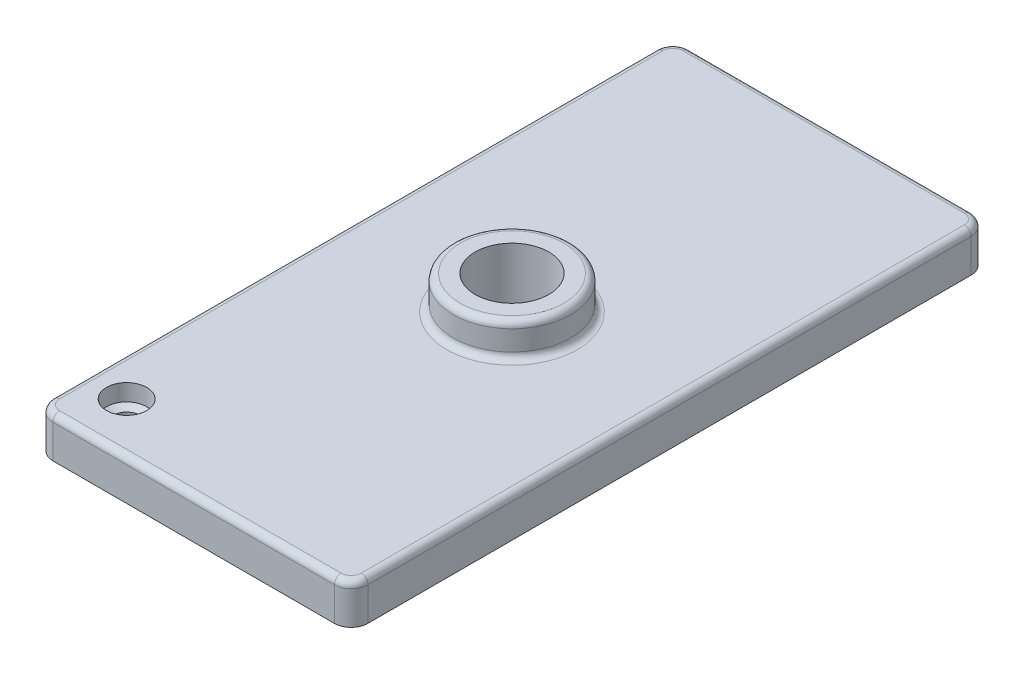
ISO-10303-21;
HEADER;
FILE_DESCRIPTION(('STEP AP214'),'2;1');
FILE_NAME('part.step','',(''),(''),'','','');
FILE_SCHEMA(('AUTOMOTIVE_DESIGN { 1 0 10303 214 1 1 1 1 }'));
ENDSEC;
DATA;
#1=APPLICATION_CONTEXT('core data for automotive mechanical design processes');
#2=APPLICATION_PROTOCOL_DEFINITION('international standard','automotive_design',2000,#1);
#3=PRODUCT_CONTEXT('',#1,'mechanical');
#4=PRODUCT('Part','Part','',(#3));
#5=PRODUCT_RELATED_PRODUCT_CATEGORY('part','',(#4));
#6=PRODUCT_DEFINITION_FORMATION('','',#4);
#7=PRODUCT_DEFINITION_CONTEXT('part definition',#1,'design');
#8=PRODUCT_DEFINITION('design','',#6,#7);
#9=PRODUCT_DEFINITION_SHAPE('','',#8);
#10=(LENGTH_UNIT() NAMED_UNIT(*) SI_UNIT(.MILLI.,.METRE.));
#11=(NAMED_UNIT(*) PLANE_ANGLE_UNIT() SI_UNIT($,.RADIAN.));
#12=(NAMED_UNIT(*) SI_UNIT($,.STERADIAN.) SOLID_ANGLE_UNIT());
#13=UNCERTAINTY_MEASURE_WITH_UNIT(LENGTH_MEASURE(1.E-05),#10,'distance_accuracy_value','');
#14=(GEOMETRIC_REPRESENTATION_CONTEXT(3) GLOBAL_UNCERTAINTY_ASSIGNED_CONTEXT((#13)) GLOBAL_UNIT_ASSIGNED_CONTEXT((#10,
#11,#12)) REPRESENTATION_CONTEXT('',''));
#15=CARTESIAN_POINT('',(0.,0.,0.));
#16=DIRECTION('',(0.,0.,1.));
#17=DIRECTION('',(1.,0.,0.));
#18=AXIS2_PLACEMENT_3D('',#15,#16,#17);
#19=CARTESIAN_POINT('',(-47.,12.,-95.));
#20=DIRECTION('',(0.,-1.,0.));
#21=DIRECTION('',(0.,0.,-1.));
#22=AXIS2_PLACEMENT_3D('',#19,#20,#21);
#23=PLANE('',#22);
#24=CARTESIAN_POINT('',(42.,12.,90.));
#25=DIRECTION('',(0.,-1.,0.));
#26=DIRECTION('',(0.,0.,-1.));
#27=AXIS2_PLACEMENT_3D('',#24,#25,#26);
#28=CIRCLE('',#27,3.);
#29=CARTESIAN_POINT('',(42.,12.,93.));
#30=VERTEX_POINT('',#29);
#31=CARTESIAN_POINT('',(45.,12.,90.));
#32=VERTEX_POINT('',#31);
#33=EDGE_CURVE('E199',#30,#32,#28,.F.);
#34=ORIENTED_EDGE('',*,*,#33,.T.);
#35=DIRECTION('',(0.,0.,-1.));
#36=VECTOR('',#35,1.);
#37=CARTESIAN_POINT('',(45.,12.,-95.));
#38=LINE('',#37,#36);
#39=CARTESIAN_POINT('',(45.,12.,-90.));
#40=VERTEX_POINT('',#39);
#41=EDGE_CURVE('E201',#32,#40,#38,.T.);
#42=ORIENTED_EDGE('',*,*,#41,.T.);
#43=CARTESIAN_POINT('',(42.,12.,-90.));
#44=DIRECTION('',(0.,-1.,0.));
#45=DIRECTION('',(0.,0.,-1.));
#46=AXIS2_PLACEMENT_3D('',#43,#44,#45);
#47=CIRCLE('',#46,3.);
#48=CARTESIAN_POINT('',(42.,12.,-93.));
#49=VERTEX_POINT('',#48);
#50=EDGE_CURVE('E204',#40,#49,#47,.F.);
#51=ORIENTED_EDGE('',*,*,#50,.T.);
#52=DIRECTION('',(-1.,0.,0.));
#53=VECTOR('',#52,1.);
#54=CARTESIAN_POINT('',(-47.,12.,-93.));
#55=LINE('',#54,#53);
#56=CARTESIAN_POINT('',(-42.,12.,-93.));
#57=VERTEX_POINT('',#56);
#58=EDGE_CURVE('E196',#49,#57,#55,.T.);
#59=ORIENTED_EDGE('',*,*,#58,.T.);
#60=CARTESIAN_POINT('',(-42.,12.,-90.));
#61=DIRECTION('',(0.,-1.,0.));
#62=DIRECTION('',(0.,0.,-1.));
#63=AXIS2_PLACEMENT_3D('',#60,#61,#62);
#64=CIRCLE('',#63,3.);
#65=CARTESIAN_POINT('',(-45.,12.,-90.));
#66=VERTEX_POINT('',#65);
#67=EDGE_CURVE('E191',#57,#66,#64,.F.);
#68=ORIENTED_EDGE('',*,*,#67,.T.);
#69=DIRECTION('',(0.,0.,1.));
#70=VECTOR('',#69,1.);
#71=CARTESIAN_POINT('',(-45.,12.,-95.));
#72=LINE('',#71,#70);
#73=CARTESIAN_POINT('',(-45.,12.,90.));
#74=VERTEX_POINT('',#73);
#75=EDGE_CURVE('E188',#66,#74,#72,.T.);
#76=ORIENTED_EDGE('',*,*,#75,.T.);
#77=CARTESIAN_POINT('',(-42.,12.,90.));
#78=DIRECTION('',(0.,-1.,0.));
#79=DIRECTION('',(0.,0.,-1.));
#80=AXIS2_PLACEMENT_3D('',#77,#78,#79);
#81=CIRCLE('',#80,3.);
#82=CARTESIAN_POINT('',(-42.,12.,93.));
#83=VERTEX_POINT('',#82);
#84=EDGE_CURVE('E195',#74,#83,#81,.F.);
#85=ORIENTED_EDGE('',*,*,#84,.T.);
#86=DIRECTION('',(1.,0.,0.));
#87=VECTOR('',#86,1.);
#88=CARTESIAN_POINT('',(-47.,12.,93.));
#89=LINE('',#88,#87);
#90=EDGE_CURVE('E198',#83,#30,#89,.T.);
#91=ORIENTED_EDGE('',*,*,#90,.T.);
#92=EDGE_LOOP('',(#34,#42,#51,#59,#68,#76,#85,#91));
#93=FACE_BOUND('',#92,.T.);
#94=CARTESIAN_POINT('',(0.,12.,0.));
#95=DIRECTION('',(0.,-1.,0.));
#96=DIRECTION('',(0.,0.,-1.));
#97=AXIS2_PLACEMENT_3D('',#94,#95,#96);
#98=CIRCLE('',#97,19.5);
#99=CARTESIAN_POINT('',(0.,12.,-19.5));
#100=VERTEX_POINT('',#99);
#101=EDGE_CURVE('E190',#100,#100,#98,.T.);
#102=ORIENTED_EDGE('',*,*,#101,.T.);
#103=EDGE_LOOP('',(#102));
#104=FACE_BOUND('',#103,.T.);
#105=CARTESIAN_POINT('',(-35.,12.,80.));
#106=DIRECTION('',(0.,1.,0.));
#107=DIRECTION('',(0.,0.,1.));
#108=AXIS2_PLACEMENT_3D('',#105,#106,#107);
#109=CIRCLE('',#108,6.);
#110=CARTESIAN_POINT('',(-35.,12.,86.));
#111=VERTEX_POINT('',#110);
#112=EDGE_CURVE('E265',#111,#111,#109,.T.);
#113=ORIENTED_EDGE('',*,*,#112,.F.);
#114=EDGE_LOOP('',(#113));
#115=FACE_BOUND('',#114,.T.);
#116=ADVANCED_FACE('F41',(#93,#104,#115),#23,.F.);
#117=CARTESIAN_POINT('',(-47.,12.,95.));
#118=DIRECTION('',(1.,0.,0.));
#119=DIRECTION('',(0.,0.,-1.));
#120=AXIS2_PLACEMENT_3D('',#117,#118,#119);
#121=PLANE('',#120);
#122=DIRECTION('',(0.,-1.,0.));
#123=VECTOR('',#122,1.);
#124=CARTESIAN_POINT('',(-47.,12.,90.));
#125=LINE('',#124,#123);
#126=CARTESIAN_POINT('',(-47.,0.,90.));
#127=VERTEX_POINT('',#126);
#128=CARTESIAN_POINT('',(-47.,10.,90.));
#129=VERTEX_POINT('',#128);
#130=EDGE_CURVE('E179',#127,#129,#125,.F.);
#131=ORIENTED_EDGE('',*,*,#130,.T.);
#132=DIRECTION('',(0.,0.,1.));
#133=VECTOR('',#132,1.);
#134=CARTESIAN_POINT('',(-47.,10.,95.));
#135=LINE('',#134,#133);
#136=CARTESIAN_POINT('',(-47.,10.,-90.));
#137=VERTEX_POINT('',#136);
#138=EDGE_CURVE('E63',#129,#137,#135,.F.);
#139=ORIENTED_EDGE('',*,*,#138,.T.);
#140=DIRECTION('',(0.,-1.,0.));
#141=VECTOR('',#140,1.);
#142=CARTESIAN_POINT('',(-47.,12.,-90.));
#143=LINE('',#142,#141);
#144=CARTESIAN_POINT('',(-47.,0.,-90.));
#145=VERTEX_POINT('',#144);
#146=EDGE_CURVE('E178',#137,#145,#143,.T.);
#147=ORIENTED_EDGE('',*,*,#146,.T.);
#148=DIRECTION('',(0.,0.,1.));
#149=VECTOR('',#148,1.);
#150=CARTESIAN_POINT('',(-47.,0.,95.));
#151=LINE('',#150,#149);
#152=EDGE_CURVE('E170',#145,#127,#151,.T.);
#153=ORIENTED_EDGE('',*,*,#152,.T.);
#154=EDGE_LOOP('',(#131,#139,#147,#153));
#155=FACE_BOUND('',#154,.T.);
#156=ADVANCED_FACE('F275',(#155),#121,.F.);
#157=CARTESIAN_POINT('',(-47.,12.,95.));
#158=DIRECTION('',(0.,0.,-1.));
#159=DIRECTION('',(-1.,0.,0.));
#160=AXIS2_PLACEMENT_3D('',#157,#158,#159);
#161=PLANE('',#160);
#162=DIRECTION('',(0.,-1.,0.));
#163=VECTOR('',#162,1.);
#164=CARTESIAN_POINT('',(42.,12.,95.));
#165=LINE('',#164,#163);
#166=CARTESIAN_POINT('',(42.,0.,95.));
#167=VERTEX_POINT('',#166);
#168=CARTESIAN_POINT('',(42.,10.,95.));
#169=VERTEX_POINT('',#168);
#170=EDGE_CURVE('E154',#167,#169,#165,.F.);
#171=ORIENTED_EDGE('',*,*,#170,.T.);
#172=DIRECTION('',(1.,0.,0.));
#173=VECTOR('',#172,1.);
#174=CARTESIAN_POINT('',(-47.,10.,95.));
#175=LINE('',#174,#173);
#176=CARTESIAN_POINT('',(-42.,10.,95.));
#177=VERTEX_POINT('',#176);
#178=EDGE_CURVE('E211',#169,#177,#175,.F.);
#179=ORIENTED_EDGE('',*,*,#178,.T.);
#180=DIRECTION('',(0.,-1.,0.));
#181=VECTOR('',#180,1.);
#182=CARTESIAN_POINT('',(-42.,12.,95.));
#183=LINE('',#182,#181);
#184=CARTESIAN_POINT('',(-42.,0.,95.));
#185=VERTEX_POINT('',#184);
#186=EDGE_CURVE('E156',#177,#185,#183,.T.);
#187=ORIENTED_EDGE('',*,*,#186,.T.);
#188=DIRECTION('',(1.,0.,0.));
#189=VECTOR('',#188,1.);
#190=CARTESIAN_POINT('',(-47.,0.,95.));
#191=LINE('',#190,#189);
#192=EDGE_CURVE('E161',#185,#167,#191,.T.);
#193=ORIENTED_EDGE('',*,*,#192,.T.);
#194=EDGE_LOOP('',(#171,#179,#187,#193));
#195=FACE_BOUND('',#194,.T.);
#196=ADVANCED_FACE('F280',(#195),#161,.F.);
#197=CARTESIAN_POINT('',(47.,12.,95.));
#198=DIRECTION('',(-1.,0.,0.));
#199=DIRECTION('',(0.,0.,1.));
#200=AXIS2_PLACEMENT_3D('',#197,#198,#199);
#201=PLANE('',#200);
#202=DIRECTION('',(0.,-1.,0.));
#203=VECTOR('',#202,1.);
#204=CARTESIAN_POINT('',(47.,12.,-90.));
#205=LINE('',#204,#203);
#206=CARTESIAN_POINT('',(47.,0.,-90.));
#207=VERTEX_POINT('',#206);
#208=CARTESIAN_POINT('',(47.,10.,-90.));
#209=VERTEX_POINT('',#208);
#210=EDGE_CURVE('E147',#207,#209,#205,.F.);
#211=ORIENTED_EDGE('',*,*,#210,.T.);
#212=DIRECTION('',(0.,0.,-1.));
#213=VECTOR('',#212,1.);
#214=CARTESIAN_POINT('',(47.,10.,95.));
#215=LINE('',#214,#213);
#216=CARTESIAN_POINT('',(47.,10.,90.));
#217=VERTEX_POINT('',#216);
#218=EDGE_CURVE('E141',#209,#217,#215,.F.);
#219=ORIENTED_EDGE('',*,*,#218,.T.);
#220=DIRECTION('',(0.,-1.,0.));
#221=VECTOR('',#220,1.);
#222=CARTESIAN_POINT('',(47.,12.,90.));
#223=LINE('',#222,#221);
#224=CARTESIAN_POINT('',(47.,0.,90.));
#225=VERTEX_POINT('',#224);
#226=EDGE_CURVE('E134',#217,#225,#223,.T.);
#227=ORIENTED_EDGE('',*,*,#226,.T.);
#228=DIRECTION('',(0.,0.,-1.));
#229=VECTOR('',#228,1.);
#230=CARTESIAN_POINT('',(47.,0.,95.));
#231=LINE('',#230,#229);
#232=EDGE_CURVE('E138',#225,#207,#231,.T.);
#233=ORIENTED_EDGE('',*,*,#232,.T.);
#234=EDGE_LOOP('',(#211,#219,#227,#233));
#235=FACE_BOUND('',#234,.T.);
#236=ADVANCED_FACE('F140',(#235),#201,.F.);
#237=CARTESIAN_POINT('',(-47.,12.,-95.));
#238=DIRECTION('',(0.,0.,1.));
#239=DIRECTION('',(1.,0.,0.));
#240=AXIS2_PLACEMENT_3D('',#237,#238,#239);
#241=PLANE('',#240);
#242=DIRECTION('',(0.,-1.,0.));
#243=VECTOR('',#242,1.);
#244=CARTESIAN_POINT('',(-42.,12.,-95.));
#245=LINE('',#244,#243);
#246=CARTESIAN_POINT('',(-42.,0.,-95.));
#247=VERTEX_POINT('',#246);
#248=CARTESIAN_POINT('',(-42.,10.,-95.));
#249=VERTEX_POINT('',#248);
#250=EDGE_CURVE('E183',#247,#249,#245,.F.);
#251=ORIENTED_EDGE('',*,*,#250,.T.);
#252=DIRECTION('',(-1.,0.,0.));
#253=VECTOR('',#252,1.);
#254=CARTESIAN_POINT('',(-47.,10.,-95.));
#255=LINE('',#254,#253);
#256=CARTESIAN_POINT('',(42.,10.,-95.));
#257=VERTEX_POINT('',#256);
#258=EDGE_CURVE('E215',#249,#257,#255,.F.);
#259=ORIENTED_EDGE('',*,*,#258,.T.);
#260=DIRECTION('',(0.,-1.,0.));
#261=VECTOR('',#260,1.);
#262=CARTESIAN_POINT('',(42.,12.,-95.));
#263=LINE('',#262,#261);
#264=CARTESIAN_POINT('',(42.,0.,-95.));
#265=VERTEX_POINT('',#264);
#266=EDGE_CURVE('E185',#257,#265,#263,.T.);
#267=ORIENTED_EDGE('',*,*,#266,.T.);
#268=DIRECTION('',(-1.,0.,0.));
#269=VECTOR('',#268,1.);
#270=CARTESIAN_POINT('',(-47.,0.,-95.));
#271=LINE('',#270,#269);
#272=EDGE_CURVE('E162',#265,#247,#271,.T.);
#273=ORIENTED_EDGE('',*,*,#272,.T.);
#274=EDGE_LOOP('',(#251,#259,#267,#273));
#275=FACE_BOUND('',#274,.T.);
#276=ADVANCED_FACE('F319',(#275),#241,.F.);
#277=CARTESIAN_POINT('',(-47.,0.,-95.));
#278=DIRECTION('',(0.,-1.,0.));
#279=DIRECTION('',(0.,0.,-1.));
#280=AXIS2_PLACEMENT_3D('',#277,#278,#279);
#281=PLANE('',#280);
#282=CARTESIAN_POINT('',(-35.,0.,80.));
#283=DIRECTION('',(0.,1.,0.));
#284=DIRECTION('',(0.,0.,1.));
#285=AXIS2_PLACEMENT_3D('',#282,#283,#284);
#286=CIRCLE('',#285,4.);
#287=CARTESIAN_POINT('',(-35.,0.,84.));
#288=VERTEX_POINT('',#287);
#289=EDGE_CURVE('E250',#288,#288,#286,.T.);
#290=ORIENTED_EDGE('',*,*,#289,.T.);
#291=EDGE_LOOP('',(#290));
#292=FACE_BOUND('',#291,.T.);
#293=CARTESIAN_POINT('',(0.,0.,0.));
#294=DIRECTION('',(0.,1.,0.));
#295=DIRECTION('',(0.,0.,1.));
#296=AXIS2_PLACEMENT_3D('',#293,#294,#295);
#297=CIRCLE('',#296,11.);
#298=CARTESIAN_POINT('',(0.,0.,11.));
#299=VERTEX_POINT('',#298);
#300=EDGE_CURVE('E267',#299,#299,#297,.T.);
#301=ORIENTED_EDGE('',*,*,#300,.T.);
#302=EDGE_LOOP('',(#301));
#303=FACE_BOUND('',#302,.T.);
#304=ORIENTED_EDGE('',*,*,#232,.F.);
#305=CARTESIAN_POINT('',(42.,0.,90.));
#306=DIRECTION('',(0.,-1.,0.));
#307=DIRECTION('',(0.,0.,-1.));
#308=AXIS2_PLACEMENT_3D('',#305,#306,#307);
#309=CIRCLE('',#308,5.);
#310=EDGE_CURVE('E146',#225,#167,#309,.T.);
#311=ORIENTED_EDGE('',*,*,#310,.T.);
#312=ORIENTED_EDGE('',*,*,#192,.F.);
#313=CARTESIAN_POINT('',(-42.,0.,90.));
#314=DIRECTION('',(0.,-1.,0.));
#315=DIRECTION('',(0.,0.,-1.));
#316=AXIS2_PLACEMENT_3D('',#313,#314,#315);
#317=CIRCLE('',#316,5.);
#318=EDGE_CURVE('E160',#185,#127,#317,.T.);
#319=ORIENTED_EDGE('',*,*,#318,.T.);
#320=ORIENTED_EDGE('',*,*,#152,.F.);
#321=CARTESIAN_POINT('',(-42.,0.,-90.));
#322=DIRECTION('',(0.,-1.,0.));
#323=DIRECTION('',(0.,0.,-1.));
#324=AXIS2_PLACEMENT_3D('',#321,#322,#323);
#325=CIRCLE('',#324,5.);
#326=EDGE_CURVE('E173',#145,#247,#325,.T.);
#327=ORIENTED_EDGE('',*,*,#326,.T.);
#328=ORIENTED_EDGE('',*,*,#272,.F.);
#329=CARTESIAN_POINT('',(42.,0.,-90.));
#330=DIRECTION('',(0.,-1.,0.));
#331=DIRECTION('',(0.,0.,-1.));
#332=AXIS2_PLACEMENT_3D('',#329,#330,#331);
#333=CIRCLE('',#332,5.);
#334=EDGE_CURVE('E143',#265,#207,#333,.T.);
#335=ORIENTED_EDGE('',*,*,#334,.T.);
#336=EDGE_LOOP('',(#304,#311,#312,#319,#320,#327,#328,#335));
#337=FACE_BOUND('',#336,.T.);
#338=ADVANCED_FACE('F158',(#292,#303,#337),#281,.T.);
#339=CARTESIAN_POINT('',(0.,22.,0.));
#340=DIRECTION('',(0.,-1.,0.));
#341=DIRECTION('',(0.,0.,-1.));
#342=AXIS2_PLACEMENT_3D('',#339,#340,#341);
#343=CYLINDRICAL_SURFACE('',#342,17.5);
#344=CARTESIAN_POINT('',(0.,14.,0.));
#345=DIRECTION('',(0.,-1.,0.));
#346=DIRECTION('',(0.,0.,-1.));
#347=AXIS2_PLACEMENT_3D('',#344,#345,#346);
#348=CIRCLE('',#347,17.5);
#349=CARTESIAN_POINT('',(0.,14.,-17.5));
#350=VERTEX_POINT('',#349);
#351=EDGE_CURVE('E49',#350,#350,#348,.F.);
#352=ORIENTED_EDGE('',*,*,#351,.T.);
#353=EDGE_LOOP('',(#352));
#354=FACE_BOUND('',#353,.T.);
#355=CARTESIAN_POINT('',(0.,20.,0.));
#356=DIRECTION('',(0.,1.,0.));
#357=DIRECTION('',(0.,0.,1.));
#358=AXIS2_PLACEMENT_3D('',#355,#356,#357);
#359=CIRCLE('',#358,17.5);
#360=CARTESIAN_POINT('',(0.,20.,17.5));
#361=VERTEX_POINT('',#360);
#362=EDGE_CURVE('E218',#361,#361,#359,.F.);
#363=ORIENTED_EDGE('',*,*,#362,.T.);
#364=EDGE_LOOP('',(#363));
#365=FACE_BOUND('',#364,.T.);
#366=ADVANCED_FACE('F314',(#354,#365),#343,.T.);
#367=CARTESIAN_POINT('',(0.,22.,0.));
#368=DIRECTION('',(0.,1.,0.));
#369=DIRECTION('',(0.,0.,1.));
#370=AXIS2_PLACEMENT_3D('',#367,#368,#369);
#371=PLANE('',#370);
#372=CARTESIAN_POINT('',(0.,22.,0.));
#373=DIRECTION('',(0.,1.,0.));
#374=DIRECTION('',(0.,0.,1.));
#375=AXIS2_PLACEMENT_3D('',#372,#373,#374);
#376=CIRCLE('',#375,15.5);
#377=CARTESIAN_POINT('',(0.,22.,15.5));
#378=VERTEX_POINT('',#377);
#379=EDGE_CURVE('E11',#378,#378,#376,.T.);
#380=ORIENTED_EDGE('',*,*,#379,.T.);
#381=EDGE_LOOP('',(#380));
#382=FACE_BOUND('',#381,.T.);
#383=CARTESIAN_POINT('',(0.,22.,0.));
#384=DIRECTION('',(0.,1.,0.));
#385=DIRECTION('',(0.,0.,1.));
#386=AXIS2_PLACEMENT_3D('',#383,#384,#385);
#387=CIRCLE('',#386,11.);
#388=CARTESIAN_POINT('',(0.,22.,11.));
#389=VERTEX_POINT('',#388);
#390=EDGE_CURVE('E264',#389,#389,#387,.T.);
#391=ORIENTED_EDGE('',*,*,#390,.F.);
#392=EDGE_LOOP('',(#391));
#393=FACE_BOUND('',#392,.T.);
#394=ADVANCED_FACE('F392',(#382,#393),#371,.T.);
#395=CARTESIAN_POINT('',(0.,0.,0.));
#396=DIRECTION('',(0.,1.,0.));
#397=DIRECTION('',(0.,0.,1.));
#398=AXIS2_PLACEMENT_3D('',#395,#396,#397);
#399=CYLINDRICAL_SURFACE('',#398,11.);
#400=ORIENTED_EDGE('',*,*,#300,.F.);
#401=EDGE_LOOP('',(#400));
#402=FACE_BOUND('',#401,.T.);
#403=ORIENTED_EDGE('',*,*,#390,.T.);
#404=EDGE_LOOP('',(#403));
#405=FACE_BOUND('',#404,.T.);
#406=ADVANCED_FACE('F399',(#402,#405),#399,.F.);
#407=CARTESIAN_POINT('',(-35.,12.,80.));
#408=DIRECTION('',(0.,1.,0.));
#409=DIRECTION('',(0.,0.,1.));
#410=AXIS2_PLACEMENT_3D('',#407,#408,#409);
#411=CYLINDRICAL_SURFACE('',#410,6.);
#412=CARTESIAN_POINT('',(-35.,7.,80.));
#413=DIRECTION('',(0.,1.,0.));
#414=DIRECTION('',(0.,0.,1.));
#415=AXIS2_PLACEMENT_3D('',#412,#413,#414);
#416=CIRCLE('',#415,6.);
#417=CARTESIAN_POINT('',(-35.,7.,86.));
#418=VERTEX_POINT('',#417);
#419=EDGE_CURVE('E260',#418,#418,#416,.T.);
#420=ORIENTED_EDGE('',*,*,#419,.F.);
#421=EDGE_LOOP('',(#420));
#422=FACE_BOUND('',#421,.T.);
#423=ORIENTED_EDGE('',*,*,#112,.T.);
#424=EDGE_LOOP('',(#423));
#425=FACE_BOUND('',#424,.T.);
#426=ADVANCED_FACE('F402',(#422,#425),#411,.F.);
#427=CARTESIAN_POINT('',(-35.,7.,80.));
#428=DIRECTION('',(0.,1.,0.));
#429=DIRECTION('',(0.,0.,1.));
#430=AXIS2_PLACEMENT_3D('',#427,#428,#429);
#431=CONICAL_SURFACE('',#430,6.,1.02974425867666);
#432=CARTESIAN_POINT('',(-35.,5.7982787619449,80.));
#433=DIRECTION('',(0.,1.,0.));
#434=DIRECTION('',(0.,0.,1.));
#435=AXIS2_PLACEMENT_3D('',#432,#433,#434);
#436=CIRCLE('',#435,4.00000000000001);
#437=CARTESIAN_POINT('',(-35.,5.7982787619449,84.));
#438=VERTEX_POINT('',#437);
#439=EDGE_CURVE('E255',#438,#438,#436,.T.);
#440=ORIENTED_EDGE('',*,*,#439,.F.);
#441=EDGE_LOOP('',(#440));
#442=FACE_BOUND('',#441,.T.);
#443=ORIENTED_EDGE('',*,*,#419,.T.);
#444=EDGE_LOOP('',(#443));
#445=FACE_BOUND('',#444,.T.);
#446=ADVANCED_FACE('F410',(#442,#445),#431,.F.);
#447=CARTESIAN_POINT('',(-35.,12.,80.));
#448=DIRECTION('',(0.,1.,0.));
#449=DIRECTION('',(0.,0.,1.));
#450=AXIS2_PLACEMENT_3D('',#447,#448,#449);
#451=CYLINDRICAL_SURFACE('',#450,4.00000000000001);
#452=ORIENTED_EDGE('',*,*,#289,.F.);
#453=EDGE_LOOP('',(#452));
#454=FACE_BOUND('',#453,.T.);
#455=ORIENTED_EDGE('',*,*,#439,.T.);
#456=EDGE_LOOP('',(#455));
#457=FACE_BOUND('',#456,.T.);
#458=ADVANCED_FACE('F326',(#454,#457),#451,.F.);
#459=CARTESIAN_POINT('',(42.,12.,90.));
#460=DIRECTION('',(0.,-1.,0.));
#461=DIRECTION('',(0.,0.,-1.));
#462=AXIS2_PLACEMENT_3D('',#459,#460,#461);
#463=CYLINDRICAL_SURFACE('',#462,5.);
#464=ORIENTED_EDGE('',*,*,#226,.F.);
#465=CARTESIAN_POINT('',(42.,10.,90.));
#466=DIRECTION('',(0.,-1.,0.));
#467=DIRECTION('',(0.,0.,-1.));
#468=AXIS2_PLACEMENT_3D('',#465,#466,#467);
#469=CIRCLE('',#468,5.);
#470=EDGE_CURVE('E208',#217,#169,#469,.T.);
#471=ORIENTED_EDGE('',*,*,#470,.T.);
#472=ORIENTED_EDGE('',*,*,#170,.F.);
#473=ORIENTED_EDGE('',*,*,#310,.F.);
#474=EDGE_LOOP('',(#464,#471,#472,#473));
#475=FACE_BOUND('',#474,.T.);
#476=ADVANCED_FACE('F148',(#475),#463,.T.);
#477=CARTESIAN_POINT('',(-42.,12.,90.));
#478=DIRECTION('',(0.,-1.,0.));
#479=DIRECTION('',(0.,0.,-1.));
#480=AXIS2_PLACEMENT_3D('',#477,#478,#479);
#481=CYLINDRICAL_SURFACE('',#480,5.);
#482=ORIENTED_EDGE('',*,*,#186,.F.);
#483=CARTESIAN_POINT('',(-42.,10.,90.));
#484=DIRECTION('',(0.,-1.,0.));
#485=DIRECTION('',(0.,0.,-1.));
#486=AXIS2_PLACEMENT_3D('',#483,#484,#485);
#487=CIRCLE('',#486,5.);
#488=EDGE_CURVE('E59',#177,#129,#487,.T.);
#489=ORIENTED_EDGE('',*,*,#488,.T.);
#490=ORIENTED_EDGE('',*,*,#130,.F.);
#491=ORIENTED_EDGE('',*,*,#318,.F.);
#492=EDGE_LOOP('',(#482,#489,#490,#491));
#493=FACE_BOUND('',#492,.T.);
#494=ADVANCED_FACE('F273',(#493),#481,.T.);
#495=CARTESIAN_POINT('',(-42.,12.,-90.));
#496=DIRECTION('',(0.,-1.,0.));
#497=DIRECTION('',(0.,0.,-1.));
#498=AXIS2_PLACEMENT_3D('',#495,#496,#497);
#499=CYLINDRICAL_SURFACE('',#498,5.);
#500=ORIENTED_EDGE('',*,*,#146,.F.);
#501=CARTESIAN_POINT('',(-42.,10.,-90.));
#502=DIRECTION('',(0.,-1.,0.));
#503=DIRECTION('',(0.,0.,-1.));
#504=AXIS2_PLACEMENT_3D('',#501,#502,#503);
#505=CIRCLE('',#504,5.);
#506=EDGE_CURVE('E217',#137,#249,#505,.T.);
#507=ORIENTED_EDGE('',*,*,#506,.T.);
#508=ORIENTED_EDGE('',*,*,#250,.F.);
#509=ORIENTED_EDGE('',*,*,#326,.F.);
#510=EDGE_LOOP('',(#500,#507,#508,#509));
#511=FACE_BOUND('',#510,.T.);
#512=ADVANCED_FACE('F332',(#511),#499,.T.);
#513=CARTESIAN_POINT('',(42.,12.,-90.));
#514=DIRECTION('',(0.,-1.,0.));
#515=DIRECTION('',(0.,0.,-1.));
#516=AXIS2_PLACEMENT_3D('',#513,#514,#515);
#517=CYLINDRICAL_SURFACE('',#516,5.);
#518=ORIENTED_EDGE('',*,*,#266,.F.);
#519=CARTESIAN_POINT('',(42.,10.,-90.));
#520=DIRECTION('',(0.,-1.,0.));
#521=DIRECTION('',(0.,0.,-1.));
#522=AXIS2_PLACEMENT_3D('',#519,#520,#521);
#523=CIRCLE('',#522,5.);
#524=EDGE_CURVE('E206',#257,#209,#523,.T.);
#525=ORIENTED_EDGE('',*,*,#524,.T.);
#526=ORIENTED_EDGE('',*,*,#210,.F.);
#527=ORIENTED_EDGE('',*,*,#334,.F.);
#528=EDGE_LOOP('',(#518,#525,#526,#527));
#529=FACE_BOUND('',#528,.T.);
#530=ADVANCED_FACE('F303',(#529),#517,.T.);
#531=CARTESIAN_POINT('',(-45.,10.,-95.));
#532=DIRECTION('',(0.,0.,1.));
#533=DIRECTION('',(1.,0.,0.));
#534=AXIS2_PLACEMENT_3D('',#531,#532,#533);
#535=CYLINDRICAL_SURFACE('',#534,2.);
#536=CARTESIAN_POINT('',(-45.,10.,-90.));
#537=DIRECTION('',(0.,0.,-1.));
#538=DIRECTION('',(-1.,0.,0.));
#539=AXIS2_PLACEMENT_3D('',#536,#537,#538);
#540=CIRCLE('',#539,2.);
#541=EDGE_CURVE('E239',#137,#66,#540,.T.);
#542=ORIENTED_EDGE('',*,*,#541,.F.);
#543=ORIENTED_EDGE('',*,*,#138,.F.);
#544=CARTESIAN_POINT('',(-45.,10.,90.));
#545=DIRECTION('',(0.,0.,1.));
#546=DIRECTION('',(1.,0.,0.));
#547=AXIS2_PLACEMENT_3D('',#544,#545,#546);
#548=CIRCLE('',#547,2.);
#549=EDGE_CURVE('E44',#74,#129,#548,.T.);
#550=ORIENTED_EDGE('',*,*,#549,.F.);
#551=ORIENTED_EDGE('',*,*,#75,.F.);
#552=EDGE_LOOP('',(#542,#543,#550,#551));
#553=FACE_BOUND('',#552,.T.);
#554=ADVANCED_FACE('F298',(#553),#535,.T.);
#555=CARTESIAN_POINT('',(-42.,10.,90.));
#556=DIRECTION('',(0.,-1.,0.));
#557=DIRECTION('',(0.,0.,-1.));
#558=AXIS2_PLACEMENT_3D('',#555,#556,#557);
#559=TOROIDAL_SURFACE('',#558,3.,2.);
#560=ORIENTED_EDGE('',*,*,#549,.T.);
#561=ORIENTED_EDGE('',*,*,#488,.F.);
#562=CARTESIAN_POINT('',(-42.,10.,93.));
#563=DIRECTION('',(1.,0.,0.));
#564=DIRECTION('',(0.,0.,-1.));
#565=AXIS2_PLACEMENT_3D('',#562,#563,#564);
#566=CIRCLE('',#565,2.);
#567=EDGE_CURVE('E238',#83,#177,#566,.T.);
#568=ORIENTED_EDGE('',*,*,#567,.F.);
#569=ORIENTED_EDGE('',*,*,#84,.F.);
#570=EDGE_LOOP('',(#560,#561,#568,#569));
#571=FACE_BOUND('',#570,.T.);
#572=ADVANCED_FACE('F291',(#571),#559,.T.);
#573=CARTESIAN_POINT('',(-42.,10.,-90.));
#574=DIRECTION('',(0.,-1.,0.));
#575=DIRECTION('',(0.,0.,-1.));
#576=AXIS2_PLACEMENT_3D('',#573,#574,#575);
#577=TOROIDAL_SURFACE('',#576,3.,2.);
#578=ORIENTED_EDGE('',*,*,#541,.T.);
#579=ORIENTED_EDGE('',*,*,#67,.F.);
#580=CARTESIAN_POINT('',(-42.,10.,-93.));
#581=DIRECTION('',(1.,0.,0.));
#582=DIRECTION('',(0.,0.,-1.));
#583=AXIS2_PLACEMENT_3D('',#580,#581,#582);
#584=CIRCLE('',#583,2.);
#585=EDGE_CURVE('E232',#249,#57,#584,.T.);
#586=ORIENTED_EDGE('',*,*,#585,.F.);
#587=ORIENTED_EDGE('',*,*,#506,.F.);
#588=EDGE_LOOP('',(#578,#579,#586,#587));
#589=FACE_BOUND('',#588,.T.);
#590=ADVANCED_FACE('F294',(#589),#577,.T.);
#591=CARTESIAN_POINT('',(-47.,10.,93.));
#592=DIRECTION('',(1.,0.,0.));
#593=DIRECTION('',(0.,0.,-1.));
#594=AXIS2_PLACEMENT_3D('',#591,#592,#593);
#595=CYLINDRICAL_SURFACE('',#594,2.);
#596=ORIENTED_EDGE('',*,*,#567,.T.);
#597=ORIENTED_EDGE('',*,*,#178,.F.);
#598=CARTESIAN_POINT('',(42.,10.,93.));
#599=DIRECTION('',(1.,0.,0.));
#600=DIRECTION('',(0.,0.,-1.));
#601=AXIS2_PLACEMENT_3D('',#598,#599,#600);
#602=CIRCLE('',#601,2.);
#603=EDGE_CURVE('E235',#30,#169,#602,.T.);
#604=ORIENTED_EDGE('',*,*,#603,.F.);
#605=ORIENTED_EDGE('',*,*,#90,.F.);
#606=EDGE_LOOP('',(#596,#597,#604,#605));
#607=FACE_BOUND('',#606,.T.);
#608=ADVANCED_FACE('F282',(#607),#595,.T.);
#609=CARTESIAN_POINT('',(-47.,10.,-93.));
#610=DIRECTION('',(-1.,0.,0.));
#611=DIRECTION('',(0.,0.,1.));
#612=AXIS2_PLACEMENT_3D('',#609,#610,#611);
#613=CYLINDRICAL_SURFACE('',#612,2.);
#614=ORIENTED_EDGE('',*,*,#585,.T.);
#615=ORIENTED_EDGE('',*,*,#58,.F.);
#616=CARTESIAN_POINT('',(42.,10.,-93.));
#617=DIRECTION('',(1.,0.,0.));
#618=DIRECTION('',(0.,0.,-1.));
#619=AXIS2_PLACEMENT_3D('',#616,#617,#618);
#620=CIRCLE('',#619,2.);
#621=EDGE_CURVE('E230',#257,#49,#620,.T.);
#622=ORIENTED_EDGE('',*,*,#621,.F.);
#623=ORIENTED_EDGE('',*,*,#258,.F.);
#624=EDGE_LOOP('',(#614,#615,#622,#623));
#625=FACE_BOUND('',#624,.T.);
#626=ADVANCED_FACE('F346',(#625),#613,.T.);
#627=CARTESIAN_POINT('',(42.,10.,90.));
#628=DIRECTION('',(0.,-1.,0.));
#629=DIRECTION('',(0.,0.,-1.));
#630=AXIS2_PLACEMENT_3D('',#627,#628,#629);
#631=TOROIDAL_SURFACE('',#630,3.,2.);
#632=ORIENTED_EDGE('',*,*,#603,.T.);
#633=ORIENTED_EDGE('',*,*,#470,.F.);
#634=CARTESIAN_POINT('',(45.,10.,90.));
#635=DIRECTION('',(0.,0.,-1.));
#636=DIRECTION('',(-1.,0.,0.));
#637=AXIS2_PLACEMENT_3D('',#634,#635,#636);
#638=CIRCLE('',#637,2.);
#639=EDGE_CURVE('E227',#32,#217,#638,.T.);
#640=ORIENTED_EDGE('',*,*,#639,.F.);
#641=ORIENTED_EDGE('',*,*,#33,.F.);
#642=EDGE_LOOP('',(#632,#633,#640,#641));
#643=FACE_BOUND('',#642,.T.);
#644=ADVANCED_FACE('F290',(#643),#631,.T.);
#645=CARTESIAN_POINT('',(42.,10.,-90.));
#646=DIRECTION('',(0.,-1.,0.));
#647=DIRECTION('',(0.,0.,-1.));
#648=AXIS2_PLACEMENT_3D('',#645,#646,#647);
#649=TOROIDAL_SURFACE('',#648,3.,2.);
#650=ORIENTED_EDGE('',*,*,#621,.T.);
#651=ORIENTED_EDGE('',*,*,#50,.F.);
#652=CARTESIAN_POINT('',(45.,10.,-90.));
#653=DIRECTION('',(0.,0.,1.));
#654=DIRECTION('',(1.,0.,0.));
#655=AXIS2_PLACEMENT_3D('',#652,#653,#654);
#656=CIRCLE('',#655,2.);
#657=EDGE_CURVE('E224',#209,#40,#656,.T.);
#658=ORIENTED_EDGE('',*,*,#657,.F.);
#659=ORIENTED_EDGE('',*,*,#524,.F.);
#660=EDGE_LOOP('',(#650,#651,#658,#659));
#661=FACE_BOUND('',#660,.T.);
#662=ADVANCED_FACE('F345',(#661),#649,.T.);
#663=CARTESIAN_POINT('',(45.,10.,-95.));
#664=DIRECTION('',(0.,0.,-1.));
#665=DIRECTION('',(-1.,0.,0.));
#666=AXIS2_PLACEMENT_3D('',#663,#664,#665);
#667=CYLINDRICAL_SURFACE('',#666,2.);
#668=ORIENTED_EDGE('',*,*,#639,.T.);
#669=ORIENTED_EDGE('',*,*,#218,.F.);
#670=ORIENTED_EDGE('',*,*,#657,.T.);
#671=ORIENTED_EDGE('',*,*,#41,.F.);
#672=EDGE_LOOP('',(#668,#669,#670,#671));
#673=FACE_BOUND('',#672,.T.);
#674=ADVANCED_FACE('F336',(#673),#667,.T.);
#675=CARTESIAN_POINT('',(0.,14.,0.));
#676=DIRECTION('',(0.,-1.,0.));
#677=DIRECTION('',(0.,0.,-1.));
#678=AXIS2_PLACEMENT_3D('',#675,#676,#677);
#679=TOROIDAL_SURFACE('',#678,19.5,2.);
#680=ORIENTED_EDGE('',*,*,#101,.F.);
#681=EDGE_LOOP('',(#680));
#682=FACE_BOUND('',#681,.T.);
#683=ORIENTED_EDGE('',*,*,#351,.F.);
#684=EDGE_LOOP('',(#683));
#685=FACE_BOUND('',#684,.T.);
#686=ADVANCED_FACE('F342',(#682,#685),#679,.F.);
#687=CARTESIAN_POINT('',(0.,20.,0.));
#688=DIRECTION('',(0.,1.,0.));
#689=DIRECTION('',(0.,0.,1.));
#690=AXIS2_PLACEMENT_3D('',#687,#688,#689);
#691=TOROIDAL_SURFACE('',#690,15.5,2.);
#692=ORIENTED_EDGE('',*,*,#362,.F.);
#693=EDGE_LOOP('',(#692));
#694=FACE_BOUND('',#693,.T.);
#695=ORIENTED_EDGE('',*,*,#379,.F.);
#696=EDGE_LOOP('',(#695));
#697=FACE_BOUND('',#696,.T.);
#698=ADVANCED_FACE('F43',(#694,#697),#691,.T.);
#699=CLOSED_SHELL('',(#116,#156,#196,#236,#276,#338,#366,#394,#406,#426,#446,#458,#476,#494,
#512,#530,#554,#572,#590,#608,#626,#644,#662,#674,#686,#698));
#700=MANIFOLD_SOLID_BREP('B2',#699);
#701=ADVANCED_BREP_SHAPE_REPRESENTATION('',(#18,#700),#14);
#702=SHAPE_DEFINITION_REPRESENTATION(#9,#701);
ENDSEC;
END-ISO-10303-21;
